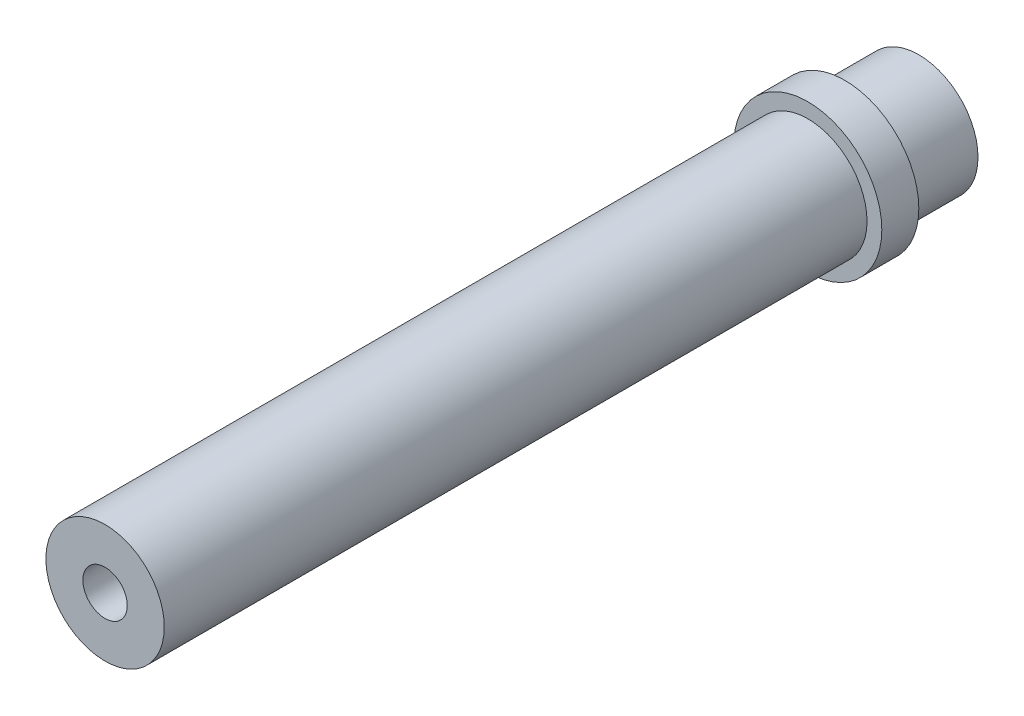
ISO-10303-21;
HEADER;
FILE_DESCRIPTION(('STEP AP214'),'2;1');
FILE_NAME('part.step','',(''),(''),'','','');
FILE_SCHEMA(('AUTOMOTIVE_DESIGN { 1 0 10303 214 1 1 1 1 }'));
ENDSEC;
DATA;
#1=APPLICATION_CONTEXT('core data for automotive mechanical design processes');
#2=APPLICATION_PROTOCOL_DEFINITION('international standard','automotive_design',2000,#1);
#3=PRODUCT_CONTEXT('',#1,'mechanical');
#4=PRODUCT('Part','Part','',(#3));
#5=PRODUCT_RELATED_PRODUCT_CATEGORY('part','',(#4));
#6=PRODUCT_DEFINITION_FORMATION('','',#4);
#7=PRODUCT_DEFINITION_CONTEXT('part definition',#1,'design');
#8=PRODUCT_DEFINITION('design','',#6,#7);
#9=PRODUCT_DEFINITION_SHAPE('','',#8);
#10=(LENGTH_UNIT() NAMED_UNIT(*) SI_UNIT(.MILLI.,.METRE.));
#11=(NAMED_UNIT(*) PLANE_ANGLE_UNIT() SI_UNIT($,.RADIAN.));
#12=(NAMED_UNIT(*) SI_UNIT($,.STERADIAN.) SOLID_ANGLE_UNIT());
#13=UNCERTAINTY_MEASURE_WITH_UNIT(LENGTH_MEASURE(1.E-05),#10,'distance_accuracy_value','');
#14=(GEOMETRIC_REPRESENTATION_CONTEXT(3) GLOBAL_UNCERTAINTY_ASSIGNED_CONTEXT((#13)) GLOBAL_UNIT_ASSIGNED_CONTEXT((#10,
#11,#12)) REPRESENTATION_CONTEXT('',''));
#15=CARTESIAN_POINT('',(0.,0.,0.));
#16=DIRECTION('',(0.,0.,1.));
#17=DIRECTION('',(1.,0.,0.));
#18=AXIS2_PLACEMENT_3D('',#15,#16,#17);
#19=CARTESIAN_POINT('',(0.,0.,110.));
#20=DIRECTION('',(0.,0.,-1.));
#21=DIRECTION('',(-1.,0.,0.));
#22=AXIS2_PLACEMENT_3D('',#19,#20,#21);
#23=CYLINDRICAL_SURFACE('',#22,8.);
#24=CARTESIAN_POINT('',(0.,0.,15.));
#25=DIRECTION('',(0.,0.,1.));
#26=DIRECTION('',(1.,0.,0.));
#27=AXIS2_PLACEMENT_3D('',#24,#25,#26);
#28=CIRCLE('',#27,8.);
#29=CARTESIAN_POINT('',(8.,0.,15.));
#30=VERTEX_POINT('',#29);
#31=EDGE_CURVE('E33',#30,#30,#28,.T.);
#32=ORIENTED_EDGE('',*,*,#31,.T.);
#33=EDGE_LOOP('',(#32));
#34=FACE_BOUND('',#33,.T.);
#35=CARTESIAN_POINT('',(0.,0.,110.));
#36=DIRECTION('',(0.,0.,1.));
#37=DIRECTION('',(1.,0.,0.));
#38=AXIS2_PLACEMENT_3D('',#35,#36,#37);
#39=CIRCLE('',#38,8.);
#40=CARTESIAN_POINT('',(8.,0.,110.));
#41=VERTEX_POINT('',#40);
#42=EDGE_CURVE('E37',#41,#41,#39,.T.);
#43=ORIENTED_EDGE('',*,*,#42,.F.);
#44=EDGE_LOOP('',(#43));
#45=FACE_BOUND('',#44,.T.);
#46=ADVANCED_FACE('F30',(#34,#45),#23,.T.);
#47=CARTESIAN_POINT('',(0.,0.,110.));
#48=DIRECTION('',(0.,0.,1.));
#49=DIRECTION('',(1.,0.,0.));
#50=AXIS2_PLACEMENT_3D('',#47,#48,#49);
#51=PLANE('',#50);
#52=CARTESIAN_POINT('',(0.,0.,110.));
#53=DIRECTION('',(0.,0.,1.));
#54=DIRECTION('',(1.,0.,0.));
#55=AXIS2_PLACEMENT_3D('',#52,#53,#54);
#56=CIRCLE('',#55,3.);
#57=CARTESIAN_POINT('',(3.,0.,110.));
#58=VERTEX_POINT('',#57);
#59=EDGE_CURVE('E59',#58,#58,#56,.T.);
#60=ORIENTED_EDGE('',*,*,#59,.F.);
#61=EDGE_LOOP('',(#60));
#62=FACE_BOUND('',#61,.T.);
#63=ORIENTED_EDGE('',*,*,#42,.T.);
#64=EDGE_LOOP('',(#63));
#65=FACE_BOUND('',#64,.T.);
#66=ADVANCED_FACE('F74',(#62,#65),#51,.T.);
#67=CARTESIAN_POINT('',(0.,0.,15.));
#68=DIRECTION('',(0.,0.,1.));
#69=DIRECTION('',(1.,0.,0.));
#70=AXIS2_PLACEMENT_3D('',#67,#68,#69);
#71=PLANE('',#70);
#72=CARTESIAN_POINT('',(0.,0.,15.));
#73=DIRECTION('',(0.,0.,1.));
#74=DIRECTION('',(1.,0.,0.));
#75=AXIS2_PLACEMENT_3D('',#72,#73,#74);
#76=CIRCLE('',#75,10.);
#77=CARTESIAN_POINT('',(10.,0.,15.));
#78=VERTEX_POINT('',#77);
#79=EDGE_CURVE('E49',#78,#78,#76,.T.);
#80=ORIENTED_EDGE('',*,*,#79,.T.);
#81=EDGE_LOOP('',(#80));
#82=FACE_BOUND('',#81,.T.);
#83=ORIENTED_EDGE('',*,*,#31,.F.);
#84=EDGE_LOOP('',(#83));
#85=FACE_BOUND('',#84,.T.);
#86=ADVANCED_FACE('F77',(#82,#85),#71,.T.);
#87=CARTESIAN_POINT('',(0.,0.,10.));
#88=DIRECTION('',(0.,0.,1.));
#89=DIRECTION('',(1.,0.,0.));
#90=AXIS2_PLACEMENT_3D('',#87,#88,#89);
#91=PLANE('',#90);
#92=CARTESIAN_POINT('',(0.,0.,10.));
#93=DIRECTION('',(0.,0.,1.));
#94=DIRECTION('',(1.,0.,0.));
#95=AXIS2_PLACEMENT_3D('',#92,#93,#94);
#96=CIRCLE('',#95,10.);
#97=CARTESIAN_POINT('',(10.,0.,10.));
#98=VERTEX_POINT('',#97);
#99=EDGE_CURVE('E46',#98,#98,#96,.T.);
#100=ORIENTED_EDGE('',*,*,#99,.F.);
#101=EDGE_LOOP('',(#100));
#102=FACE_BOUND('',#101,.T.);
#103=CARTESIAN_POINT('',(0.,0.,9.99999999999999));
#104=DIRECTION('',(0.,0.,1.));
#105=DIRECTION('',(1.,0.,0.));
#106=AXIS2_PLACEMENT_3D('',#103,#104,#105);
#107=CIRCLE('',#106,8.);
#108=CARTESIAN_POINT('',(8.,0.,9.99999999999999));
#109=VERTEX_POINT('',#108);
#110=EDGE_CURVE('E10',#109,#109,#107,.T.);
#111=ORIENTED_EDGE('',*,*,#110,.T.);
#112=EDGE_LOOP('',(#111));
#113=FACE_BOUND('',#112,.T.);
#114=ADVANCED_FACE('F105',(#102,#113),#91,.F.);
#115=CARTESIAN_POINT('',(0.,0.,15.));
#116=DIRECTION('',(0.,0.,-1.));
#117=DIRECTION('',(-1.,0.,0.));
#118=AXIS2_PLACEMENT_3D('',#115,#116,#117);
#119=CYLINDRICAL_SURFACE('',#118,10.);
#120=ORIENTED_EDGE('',*,*,#79,.F.);
#121=EDGE_LOOP('',(#120));
#122=FACE_BOUND('',#121,.T.);
#123=ORIENTED_EDGE('',*,*,#99,.T.);
#124=EDGE_LOOP('',(#123));
#125=FACE_BOUND('',#124,.T.);
#126=ADVANCED_FACE('F97',(#122,#125),#119,.T.);
#127=CARTESIAN_POINT('',(0.,0.,0.));
#128=DIRECTION('',(0.,0.,1.));
#129=DIRECTION('',(1.,0.,0.));
#130=AXIS2_PLACEMENT_3D('',#127,#128,#129);
#131=PLANE('',#130);
#132=CARTESIAN_POINT('',(0.,0.,0.));
#133=DIRECTION('',(0.,0.,-1.));
#134=DIRECTION('',(-1.,0.,0.));
#135=AXIS2_PLACEMENT_3D('',#132,#133,#134);
#136=CIRCLE('',#135,3.);
#137=CARTESIAN_POINT('',(-3.,0.,0.));
#138=VERTEX_POINT('',#137);
#139=EDGE_CURVE('E53',#138,#138,#136,.T.);
#140=ORIENTED_EDGE('',*,*,#139,.F.);
#141=EDGE_LOOP('',(#140));
#142=FACE_BOUND('',#141,.T.);
#143=CARTESIAN_POINT('',(0.,0.,0.));
#144=DIRECTION('',(0.,0.,1.));
#145=DIRECTION('',(1.,0.,0.));
#146=AXIS2_PLACEMENT_3D('',#143,#144,#145);
#147=CIRCLE('',#146,8.);
#148=CARTESIAN_POINT('',(8.,0.,0.));
#149=VERTEX_POINT('',#148);
#150=EDGE_CURVE('E41',#149,#149,#147,.T.);
#151=ORIENTED_EDGE('',*,*,#150,.F.);
#152=EDGE_LOOP('',(#151));
#153=FACE_BOUND('',#152,.T.);
#154=ADVANCED_FACE('F89',(#142,#153),#131,.F.);
#155=ORIENTED_EDGE('',*,*,#150,.T.);
#156=EDGE_LOOP('',(#155));
#157=FACE_BOUND('',#156,.T.);
#158=ORIENTED_EDGE('',*,*,#110,.F.);
#159=EDGE_LOOP('',(#158));
#160=FACE_BOUND('',#159,.T.);
#161=ADVANCED_FACE('F83',(#157,#160),#23,.T.);
#162=CARTESIAN_POINT('',(0.,0.,15.));
#163=DIRECTION('',(0.,0.,-1.));
#164=DIRECTION('',(-1.,0.,0.));
#165=AXIS2_PLACEMENT_3D('',#162,#163,#164);
#166=CYLINDRICAL_SURFACE('',#165,3.);
#167=CARTESIAN_POINT('',(0.,0.,15.));
#168=DIRECTION('',(0.,0.,-1.));
#169=DIRECTION('',(-1.,0.,0.));
#170=AXIS2_PLACEMENT_3D('',#167,#168,#169);
#171=CIRCLE('',#170,3.);
#172=CARTESIAN_POINT('',(-3.,0.,15.));
#173=VERTEX_POINT('',#172);
#174=EDGE_CURVE('E50',#173,#173,#171,.T.);
#175=ORIENTED_EDGE('',*,*,#174,.F.);
#176=EDGE_LOOP('',(#175));
#177=FACE_BOUND('',#176,.T.);
#178=ORIENTED_EDGE('',*,*,#139,.T.);
#179=EDGE_LOOP('',(#178));
#180=FACE_BOUND('',#179,.T.);
#181=ADVANCED_FACE('F88',(#177,#180),#166,.F.);
#182=CARTESIAN_POINT('',(0.,0.,15.));
#183=DIRECTION('',(0.,0.,-1.));
#184=DIRECTION('',(-1.,0.,0.));
#185=AXIS2_PLACEMENT_3D('',#182,#183,#184);
#186=PLANE('',#185);
#187=ORIENTED_EDGE('',*,*,#174,.T.);
#188=EDGE_LOOP('',(#187));
#189=FACE_BOUND('',#188,.T.);
#190=ADVANCED_FACE('F70',(#189),#186,.T.);
#191=CARTESIAN_POINT('',(0.,0.,95.));
#192=DIRECTION('',(0.,0.,1.));
#193=DIRECTION('',(1.,0.,0.));
#194=AXIS2_PLACEMENT_3D('',#191,#192,#193);
#195=CYLINDRICAL_SURFACE('',#194,3.);
#196=CARTESIAN_POINT('',(0.,0.,95.));
#197=DIRECTION('',(0.,0.,1.));
#198=DIRECTION('',(1.,0.,0.));
#199=AXIS2_PLACEMENT_3D('',#196,#197,#198);
#200=CIRCLE('',#199,3.);
#201=CARTESIAN_POINT('',(3.,0.,95.));
#202=VERTEX_POINT('',#201);
#203=EDGE_CURVE('E56',#202,#202,#200,.T.);
#204=ORIENTED_EDGE('',*,*,#203,.F.);
#205=EDGE_LOOP('',(#204));
#206=FACE_BOUND('',#205,.T.);
#207=ORIENTED_EDGE('',*,*,#59,.T.);
#208=EDGE_LOOP('',(#207));
#209=FACE_BOUND('',#208,.T.);
#210=ADVANCED_FACE('F67',(#206,#209),#195,.F.);
#211=CARTESIAN_POINT('',(0.,0.,95.));
#212=DIRECTION('',(0.,0.,1.));
#213=DIRECTION('',(1.,0.,0.));
#214=AXIS2_PLACEMENT_3D('',#211,#212,#213);
#215=PLANE('',#214);
#216=ORIENTED_EDGE('',*,*,#203,.T.);
#217=EDGE_LOOP('',(#216));
#218=FACE_BOUND('',#217,.T.);
#219=ADVANCED_FACE('F65',(#218),#215,.T.);
#220=CLOSED_SHELL('',(#46,#66,#86,#114,#126,#154,#161,#181,#190,#210,#219));
#221=MANIFOLD_SOLID_BREP('B2',#220);
#222=ADVANCED_BREP_SHAPE_REPRESENTATION('',(#18,#221),#14);
#223=SHAPE_DEFINITION_REPRESENTATION(#9,#222);
ENDSEC;
END-ISO-10303-21;
